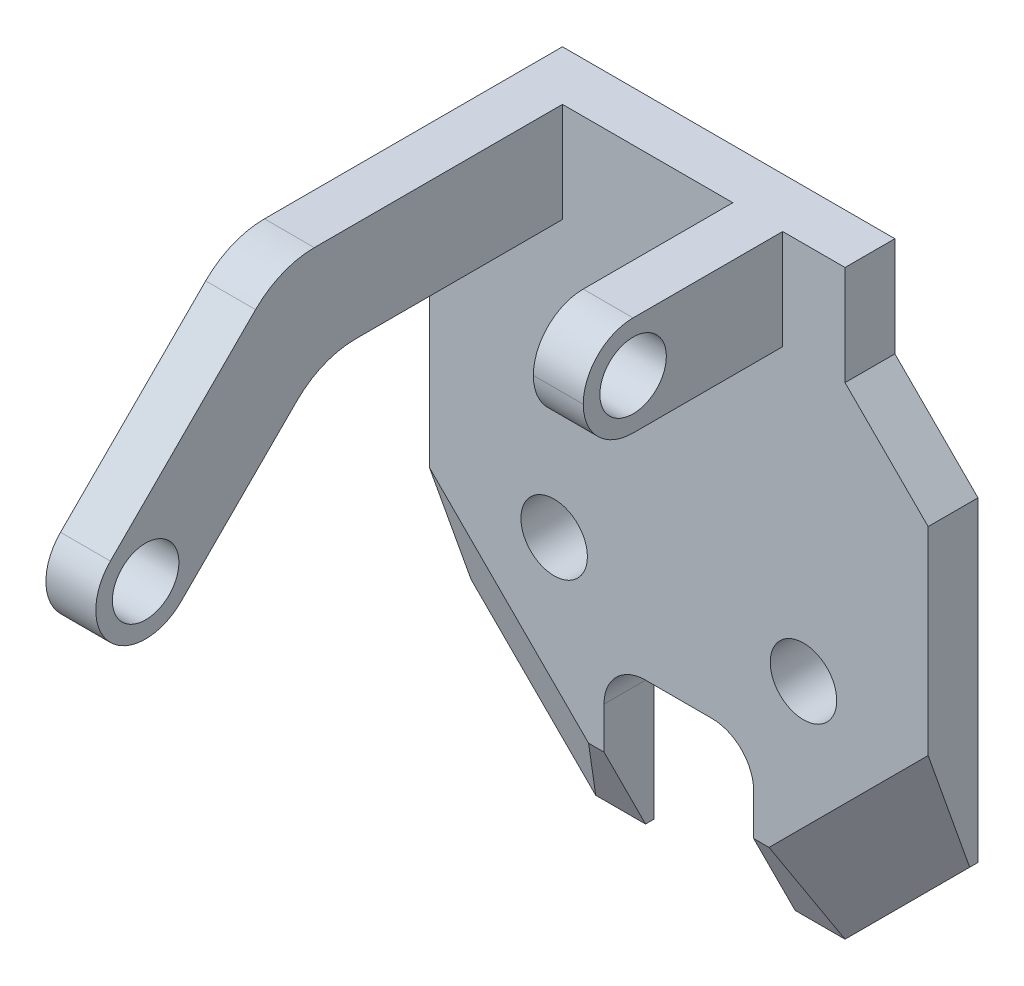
ISO-10303-21;
HEADER;
FILE_DESCRIPTION(('STEP AP214'),'2;1');
FILE_NAME('part.step','',(''),(''),'','','');
FILE_SCHEMA(('AUTOMOTIVE_DESIGN { 1 0 10303 214 1 1 1 1 }'));
ENDSEC;
DATA;
#1=APPLICATION_CONTEXT('core data for automotive mechanical design processes');
#2=APPLICATION_PROTOCOL_DEFINITION('international standard','automotive_design',2000,#1);
#3=PRODUCT_CONTEXT('',#1,'mechanical');
#4=PRODUCT('Part','Part','',(#3));
#5=PRODUCT_RELATED_PRODUCT_CATEGORY('part','',(#4));
#6=PRODUCT_DEFINITION_FORMATION('','',#4);
#7=PRODUCT_DEFINITION_CONTEXT('part definition',#1,'design');
#8=PRODUCT_DEFINITION('design','',#6,#7);
#9=PRODUCT_DEFINITION_SHAPE('','',#8);
#10=(LENGTH_UNIT() NAMED_UNIT(*) SI_UNIT(.MILLI.,.METRE.));
#11=(NAMED_UNIT(*) PLANE_ANGLE_UNIT() SI_UNIT($,.RADIAN.));
#12=(NAMED_UNIT(*) SI_UNIT($,.STERADIAN.) SOLID_ANGLE_UNIT());
#13=UNCERTAINTY_MEASURE_WITH_UNIT(LENGTH_MEASURE(1.E-05),#10,'distance_accuracy_value','');
#14=(GEOMETRIC_REPRESENTATION_CONTEXT(3) GLOBAL_UNCERTAINTY_ASSIGNED_CONTEXT((#13)) GLOBAL_UNIT_ASSIGNED_CONTEXT((#10,
#11,#12)) REPRESENTATION_CONTEXT('',''));
#15=CARTESIAN_POINT('',(0.,0.,0.));
#16=DIRECTION('',(0.,0.,1.));
#17=DIRECTION('',(1.,0.,0.));
#18=AXIS2_PLACEMENT_3D('',#15,#16,#17);
#19=CARTESIAN_POINT('',(0.,0.,6.));
#20=DIRECTION('',(0.,0.,1.));
#21=DIRECTION('',(1.,0.,0.));
#22=AXIS2_PLACEMENT_3D('',#19,#20,#21);
#23=PLANE('',#22);
#24=CARTESIAN_POINT('',(-37.6055090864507,-42.5992218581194,6.));
#25=DIRECTION('',(0.,0.,1.));
#26=DIRECTION('',(1.,0.,0.));
#27=AXIS2_PLACEMENT_3D('',#24,#25,#26);
#28=CIRCLE('',#27,4.00000000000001);
#29=CARTESIAN_POINT('',(-33.6055090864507,-42.5992218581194,6.));
#30=VERTEX_POINT('',#29);
#31=EDGE_CURVE('E479',#30,#30,#28,.T.);
#32=ORIENTED_EDGE('',*,*,#31,.F.);
#33=EDGE_LOOP('',(#32));
#34=FACE_BOUND('',#33,.T.);
#35=CARTESIAN_POINT('',(-7.60550908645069,-42.5992218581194,6.));
#36=DIRECTION('',(0.,0.,1.));
#37=DIRECTION('',(1.,0.,0.));
#38=AXIS2_PLACEMENT_3D('',#35,#36,#37);
#39=CIRCLE('',#38,4.);
#40=CARTESIAN_POINT('',(-3.60550908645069,-42.5992218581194,6.));
#41=VERTEX_POINT('',#40);
#42=EDGE_CURVE('E484',#41,#41,#39,.T.);
#43=ORIENTED_EDGE('',*,*,#42,.F.);
#44=EDGE_LOOP('',(#43));
#45=FACE_BOUND('',#44,.T.);
#46=DIRECTION('',(1.,0.,0.));
#47=VECTOR('',#46,1.);
#48=CARTESIAN_POINT('',(-16.1055090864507,-8.97033508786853,6.));
#49=LINE('',#48,#47);
#50=CARTESIAN_POINT('',(-16.1055090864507,-8.97033508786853,6.));
#51=VERTEX_POINT('',#50);
#52=CARTESIAN_POINT('',(-10.1055090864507,-8.97033508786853,6.));
#53=VERTEX_POINT('',#52);
#54=EDGE_CURVE('E253',#51,#53,#49,.T.);
#55=ORIENTED_EDGE('',*,*,#54,.F.);
#56=DIRECTION('',(0.,-1.,0.));
#57=VECTOR('',#56,1.);
#58=CARTESIAN_POINT('',(-16.1055090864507,0.,6.));
#59=LINE('',#58,#57);
#60=CARTESIAN_POINT('',(-16.1055090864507,3.02966491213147,6.));
#61=VERTEX_POINT('',#60);
#62=EDGE_CURVE('E251',#61,#51,#59,.T.);
#63=ORIENTED_EDGE('',*,*,#62,.F.);
#64=DIRECTION('',(-1.,0.,0.));
#65=VECTOR('',#64,1.);
#66=CARTESIAN_POINT('',(-2.6055090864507,3.02966491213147,6.));
#67=LINE('',#66,#65);
#68=CARTESIAN_POINT('',(-36.6055090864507,3.02966491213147,6.));
#69=VERTEX_POINT('',#68);
#70=EDGE_CURVE('E238',#61,#69,#67,.T.);
#71=ORIENTED_EDGE('',*,*,#70,.T.);
#72=DIRECTION('',(0.,-1.,0.));
#73=VECTOR('',#72,1.);
#74=CARTESIAN_POINT('',(-36.6055090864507,0.,6.));
#75=LINE('',#74,#73);
#76=CARTESIAN_POINT('',(-36.6055090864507,-8.97033508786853,6.));
#77=VERTEX_POINT('',#76);
#78=EDGE_CURVE('E311',#69,#77,#75,.T.);
#79=ORIENTED_EDGE('',*,*,#78,.T.);
#80=DIRECTION('',(-1.,0.,0.));
#81=VECTOR('',#80,1.);
#82=CARTESIAN_POINT('',(0.,-8.97033508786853,6.));
#83=LINE('',#82,#81);
#84=CARTESIAN_POINT('',(-42.6055090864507,-8.97033508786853,6.));
#85=VERTEX_POINT('',#84);
#86=EDGE_CURVE('E327',#77,#85,#83,.T.);
#87=ORIENTED_EDGE('',*,*,#86,.T.);
#88=DIRECTION('',(-0.707106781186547,-0.707106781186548,0.));
#89=VECTOR('',#88,1.);
#90=CARTESIAN_POINT('',(-42.6055090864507,-8.97033508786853,6.));
#91=LINE('',#90,#89);
#92=CARTESIAN_POINT('',(-52.6055090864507,-18.9703350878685,6.));
#93=VERTEX_POINT('',#92);
#94=EDGE_CURVE('E351',#85,#93,#91,.T.);
#95=ORIENTED_EDGE('',*,*,#94,.T.);
#96=DIRECTION('',(0.,-1.,0.));
#97=VECTOR('',#96,1.);
#98=CARTESIAN_POINT('',(-52.6055090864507,-18.9703350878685,6.));
#99=LINE('',#98,#97);
#100=CARTESIAN_POINT('',(-52.6055090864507,-42.8281994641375,6.));
#101=VERTEX_POINT('',#100);
#102=EDGE_CURVE('E353',#93,#101,#99,.T.);
#103=ORIENTED_EDGE('',*,*,#102,.T.);
#104=DIRECTION('',(0.707106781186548,-0.707106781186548,0.));
#105=VECTOR('',#104,1.);
#106=CARTESIAN_POINT('',(-30.5344412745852,-64.899267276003,6.));
#107=LINE('',#106,#105);
#108=CARTESIAN_POINT('',(-33.4633734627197,-61.9703350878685,6.));
#109=VERTEX_POINT('',#108);
#110=EDGE_CURVE('E435',#101,#109,#107,.T.);
#111=ORIENTED_EDGE('',*,*,#110,.T.);
#112=DIRECTION('',(1.,0.,0.));
#113=VECTOR('',#112,1.);
#114=CARTESIAN_POINT('',(-31.6055090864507,-61.9703350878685,6.));
#115=LINE('',#114,#113);
#116=CARTESIAN_POINT('',(-31.6055090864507,-61.9703350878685,6.));
#117=VERTEX_POINT('',#116);
#118=EDGE_CURVE('E433',#109,#117,#115,.T.);
#119=ORIENTED_EDGE('',*,*,#118,.T.);
#120=DIRECTION('',(0.,-1.,0.));
#121=VECTOR('',#120,1.);
#122=CARTESIAN_POINT('',(-31.6055090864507,-91.9703350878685,6.));
#123=LINE('',#122,#121);
#124=CARTESIAN_POINT('',(-31.6055090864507,-56.9703350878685,6.));
#125=VERTEX_POINT('',#124);
#126=EDGE_CURVE('E335',#125,#117,#123,.T.);
#127=ORIENTED_EDGE('',*,*,#126,.F.);
#128=CARTESIAN_POINT('',(-26.6055090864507,-56.9703350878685,6.));
#129=DIRECTION('',(0.,0.,1.));
#130=DIRECTION('',(1.,0.,0.));
#131=AXIS2_PLACEMENT_3D('',#128,#129,#130);
#132=CIRCLE('',#131,5.);
#133=CARTESIAN_POINT('',(-26.6055090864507,-51.9703350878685,6.));
#134=VERTEX_POINT('',#133);
#135=EDGE_CURVE('E429',#125,#134,#132,.F.);
#136=ORIENTED_EDGE('',*,*,#135,.T.);
#137=DIRECTION('',(-1.,0.,0.));
#138=VECTOR('',#137,1.);
#139=CARTESIAN_POINT('',(-31.6055090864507,-51.9703350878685,6.));
#140=LINE('',#139,#138);
#141=CARTESIAN_POINT('',(-18.6055090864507,-51.9703350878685,6.));
#142=VERTEX_POINT('',#141);
#143=EDGE_CURVE('E340',#142,#134,#140,.T.);
#144=ORIENTED_EDGE('',*,*,#143,.F.);
#145=CARTESIAN_POINT('',(-18.6055090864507,-56.9703350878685,6.));
#146=DIRECTION('',(0.,0.,1.));
#147=DIRECTION('',(1.,0.,0.));
#148=AXIS2_PLACEMENT_3D('',#145,#146,#147);
#149=CIRCLE('',#148,5.);
#150=CARTESIAN_POINT('',(-13.6055090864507,-56.9703350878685,6.));
#151=VERTEX_POINT('',#150);
#152=EDGE_CURVE('E424',#142,#151,#149,.F.);
#153=ORIENTED_EDGE('',*,*,#152,.T.);
#154=DIRECTION('',(0.,1.,0.));
#155=VECTOR('',#154,1.);
#156=CARTESIAN_POINT('',(-13.6055090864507,-91.9703350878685,6.));
#157=LINE('',#156,#155);
#158=CARTESIAN_POINT('',(-13.6055090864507,-61.9703350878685,6.));
#159=VERTEX_POINT('',#158);
#160=EDGE_CURVE('E338',#159,#151,#157,.T.);
#161=ORIENTED_EDGE('',*,*,#160,.F.);
#162=DIRECTION('',(1.,0.,0.));
#163=VECTOR('',#162,1.);
#164=CARTESIAN_POINT('',(-7.60550908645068,-61.9703350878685,6.));
#165=LINE('',#164,#163);
#166=CARTESIAN_POINT('',(-11.7476447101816,-61.9703350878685,6.));
#167=VERTEX_POINT('',#166);
#168=EDGE_CURVE('E438',#159,#167,#165,.T.);
#169=ORIENTED_EDGE('',*,*,#168,.T.);
#170=DIRECTION('',(0.707106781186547,0.707106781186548,0.));
#171=VECTOR('',#170,1.);
#172=CARTESIAN_POINT('',(0.323423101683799,-49.899267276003,6.));
#173=LINE('',#172,#171);
#174=CARTESIAN_POINT('',(7.39449091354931,-42.8281994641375,6.));
#175=VERTEX_POINT('',#174);
#176=EDGE_CURVE('E440',#167,#175,#173,.T.);
#177=ORIENTED_EDGE('',*,*,#176,.T.);
#178=DIRECTION('',(0.,1.,0.));
#179=VECTOR('',#178,1.);
#180=CARTESIAN_POINT('',(7.39449091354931,-56.9703350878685,6.));
#181=LINE('',#180,#179);
#182=CARTESIAN_POINT('',(7.3944909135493,-18.9703350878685,6.));
#183=VERTEX_POINT('',#182);
#184=EDGE_CURVE('E357',#175,#183,#181,.T.);
#185=ORIENTED_EDGE('',*,*,#184,.T.);
#186=DIRECTION('',(-0.707106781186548,0.707106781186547,0.));
#187=VECTOR('',#186,1.);
#188=CARTESIAN_POINT('',(7.3944909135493,-18.9703350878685,6.));
#189=LINE('',#188,#187);
#190=CARTESIAN_POINT('',(-2.6055090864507,-8.97033508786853,6.));
#191=VERTEX_POINT('',#190);
#192=EDGE_CURVE('E248',#183,#191,#189,.T.);
#193=ORIENTED_EDGE('',*,*,#192,.T.);
#194=DIRECTION('',(0.,-1.,0.));
#195=VECTOR('',#194,1.);
#196=CARTESIAN_POINT('',(-2.6055090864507,-8.97033508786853,6.));
#197=LINE('',#196,#195);
#198=CARTESIAN_POINT('',(-2.6055090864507,3.02966491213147,6.));
#199=VERTEX_POINT('',#198);
#200=EDGE_CURVE('E278',#199,#191,#197,.T.);
#201=ORIENTED_EDGE('',*,*,#200,.F.);
#202=CARTESIAN_POINT('',(-10.1055090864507,3.02966491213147,6.));
#203=VERTEX_POINT('',#202);
#204=EDGE_CURVE('E247',#199,#203,#67,.T.);
#205=ORIENTED_EDGE('',*,*,#204,.T.);
#206=DIRECTION('',(0.,-1.,0.));
#207=VECTOR('',#206,1.);
#208=CARTESIAN_POINT('',(-10.1055090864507,0.,6.));
#209=LINE('',#208,#207);
#210=EDGE_CURVE('E258',#203,#53,#209,.T.);
#211=ORIENTED_EDGE('',*,*,#210,.T.);
#212=EDGE_LOOP('',(#55,#63,#71,#79,#87,#95,#103,#111,#119,#127,#136,#144,#153,#161,#169,#177,
#185,#193,#201,#205,#211));
#213=FACE_BOUND('',#212,.T.);
#214=ADVANCED_FACE('F40',(#34,#45,#213),#23,.T.);
#215=CARTESIAN_POINT('',(-37.6055090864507,-71.9703350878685,6.));
#216=DIRECTION('',(0.,1.,0.));
#217=DIRECTION('',(0.,0.,1.));
#218=AXIS2_PLACEMENT_3D('',#215,#216,#217);
#219=PLANE('',#218);
#220=DIRECTION('',(0.,0.,-1.));
#221=VECTOR('',#220,1.);
#222=CARTESIAN_POINT('',(-7.60550908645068,-71.9703350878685,6.));
#223=LINE('',#222,#221);
#224=CARTESIAN_POINT('',(-7.60550908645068,-71.9703350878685,1.));
#225=VERTEX_POINT('',#224);
#226=CARTESIAN_POINT('',(-7.60550908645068,-71.9703350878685,0.));
#227=VERTEX_POINT('',#226);
#228=EDGE_CURVE('E399',#225,#227,#223,.T.);
#229=ORIENTED_EDGE('',*,*,#228,.F.);
#230=DIRECTION('',(-1.,0.,0.));
#231=VECTOR('',#230,1.);
#232=CARTESIAN_POINT('',(-13.6055090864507,-71.9703350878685,1.));
#233=LINE('',#232,#231);
#234=CARTESIAN_POINT('',(-13.6055090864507,-71.9703350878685,1.));
#235=VERTEX_POINT('',#234);
#236=EDGE_CURVE('E447',#225,#235,#233,.T.);
#237=ORIENTED_EDGE('',*,*,#236,.T.);
#238=DIRECTION('',(0.,0.,-1.));
#239=VECTOR('',#238,1.);
#240=CARTESIAN_POINT('',(-13.6055090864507,-71.9703350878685,6.));
#241=LINE('',#240,#239);
#242=CARTESIAN_POINT('',(-13.6055090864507,-71.9703350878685,0.));
#243=VERTEX_POINT('',#242);
#244=EDGE_CURVE('E348',#235,#243,#241,.T.);
#245=ORIENTED_EDGE('',*,*,#244,.T.);
#246=DIRECTION('',(1.,0.,0.));
#247=VECTOR('',#246,1.);
#248=CARTESIAN_POINT('',(-37.6055090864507,-71.9703350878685,0.));
#249=LINE('',#248,#247);
#250=EDGE_CURVE('E372',#243,#227,#249,.T.);
#251=ORIENTED_EDGE('',*,*,#250,.T.);
#252=EDGE_LOOP('',(#229,#237,#245,#251));
#253=FACE_BOUND('',#252,.T.);
#254=ADVANCED_FACE('F495',(#253),#219,.F.);
#255=CARTESIAN_POINT('',(-42.6055090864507,3.02966491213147,6.));
#256=DIRECTION('',(1.,0.,0.));
#257=DIRECTION('',(0.,0.,-1.));
#258=AXIS2_PLACEMENT_3D('',#255,#256,#257);
#259=PLANE('',#258);
#260=CARTESIAN_POINT('',(-42.6055090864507,-21.609450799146,56.1538343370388));
#261=DIRECTION('',(-1.,0.,0.));
#262=DIRECTION('',(0.,0.,1.));
#263=AXIS2_PLACEMENT_3D('',#260,#261,#262);
#264=CIRCLE('',#263,4.00000000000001);
#265=CARTESIAN_POINT('',(-42.6055090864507,-21.609450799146,60.1538343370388));
#266=VERTEX_POINT('',#265);
#267=EDGE_CURVE('E274',#266,#266,#264,.T.);
#268=ORIENTED_EDGE('',*,*,#267,.F.);
#269=EDGE_LOOP('',(#268));
#270=FACE_BOUND('',#269,.T.);
#271=DIRECTION('',(0.,-1.,0.));
#272=VECTOR('',#271,1.);
#273=CARTESIAN_POINT('',(-42.6055090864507,3.02966491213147,0.));
#274=LINE('',#273,#272);
#275=CARTESIAN_POINT('',(-42.6055090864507,3.02966491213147,0.));
#276=VERTEX_POINT('',#275);
#277=CARTESIAN_POINT('',(-42.6055090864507,-8.97033508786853,0.));
#278=VERTEX_POINT('',#277);
#279=EDGE_CURVE('E350',#276,#278,#274,.T.);
#280=ORIENTED_EDGE('',*,*,#279,.T.);
#281=DIRECTION('',(0.,0.,-1.));
#282=VECTOR('',#281,1.);
#283=CARTESIAN_POINT('',(-42.6055090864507,-8.97033508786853,6.));
#284=LINE('',#283,#282);
#285=EDGE_CURVE('E408',#85,#278,#284,.T.);
#286=ORIENTED_EDGE('',*,*,#285,.F.);
#287=DIRECTION('',(0.,0.,-1.));
#288=VECTOR('',#287,1.);
#289=CARTESIAN_POINT('',(-42.6055090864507,-8.97033508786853,0.));
#290=LINE('',#289,#288);
#291=CARTESIAN_POINT('',(-42.6055090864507,-8.97033508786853,30.8873016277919));
#292=VERTEX_POINT('',#291);
#293=EDGE_CURVE('E280',#292,#85,#290,.T.);
#294=ORIENTED_EDGE('',*,*,#293,.F.);
#295=CARTESIAN_POINT('',(-42.6055090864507,-18.9703350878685,30.8873016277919));
#296=DIRECTION('',(-1.,0.,0.));
#297=DIRECTION('',(0.,0.,-1.));
#298=AXIS2_PLACEMENT_3D('',#295,#296,#297);
#299=CIRCLE('',#298,10.);
#300=CARTESIAN_POINT('',(-42.6055090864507,-11.8992672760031,37.9583694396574));
#301=VERTEX_POINT('',#300);
#302=EDGE_CURVE('E299',#301,#292,#299,.T.);
#303=ORIENTED_EDGE('',*,*,#302,.F.);
#304=DIRECTION('',(0.,0.707106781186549,-0.707106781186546));
#305=VECTOR('',#304,1.);
#306=CARTESIAN_POINT('',(-42.6055090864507,-11.8992672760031,37.9583694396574));
#307=LINE('',#306,#305);
#308=CARTESIAN_POINT('',(-42.6055090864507,-25.8520914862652,51.9111936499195));
#309=VERTEX_POINT('',#308);
#310=EDGE_CURVE('E301',#309,#301,#307,.T.);
#311=ORIENTED_EDGE('',*,*,#310,.F.);
#312=CARTESIAN_POINT('',(-42.6055090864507,-21.609450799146,56.1538343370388));
#313=DIRECTION('',(1.,0.,0.));
#314=DIRECTION('',(0.,0.,-1.));
#315=AXIS2_PLACEMENT_3D('',#312,#313,#314);
#316=CIRCLE('',#315,6.);
#317=CARTESIAN_POINT('',(-42.6055090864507,-17.3668101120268,60.3964750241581));
#318=VERTEX_POINT('',#317);
#319=EDGE_CURVE('E303',#318,#309,#316,.T.);
#320=ORIENTED_EDGE('',*,*,#319,.F.);
#321=DIRECTION('',(0.,-0.707106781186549,0.707106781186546));
#322=VECTOR('',#321,1.);
#323=CARTESIAN_POINT('',(-42.6055090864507,0.100732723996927,42.9289321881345));
#324=LINE('',#323,#322);
#325=CARTESIAN_POINT('',(-42.6055090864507,0.10073272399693,42.9289321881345));
#326=VERTEX_POINT('',#325);
#327=EDGE_CURVE('E305',#326,#318,#324,.T.);
#328=ORIENTED_EDGE('',*,*,#327,.F.);
#329=CARTESIAN_POINT('',(-42.6055090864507,-6.97033508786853,35.857864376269));
#330=DIRECTION('',(1.,0.,0.));
#331=DIRECTION('',(0.,0.,-1.));
#332=AXIS2_PLACEMENT_3D('',#329,#330,#331);
#333=CIRCLE('',#332,9.99999999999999);
#334=CARTESIAN_POINT('',(-42.6055090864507,3.02966491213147,35.857864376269));
#335=VERTEX_POINT('',#334);
#336=EDGE_CURVE('E285',#335,#326,#333,.T.);
#337=ORIENTED_EDGE('',*,*,#336,.F.);
#338=DIRECTION('',(0.,0.,-1.));
#339=VECTOR('',#338,1.);
#340=CARTESIAN_POINT('',(-42.6055090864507,3.02966491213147,6.));
#341=LINE('',#340,#339);
#342=EDGE_CURVE('E361',#335,#276,#341,.T.);
#343=ORIENTED_EDGE('',*,*,#342,.T.);
#344=EDGE_LOOP('',(#280,#286,#294,#303,#311,#320,#328,#337,#343));
#345=FACE_BOUND('',#344,.T.);
#346=ADVANCED_FACE('F501',(#270,#345),#259,.F.);
#347=CARTESIAN_POINT('',(-42.6055090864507,-8.97033508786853,6.));
#348=DIRECTION('',(0.707106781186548,-0.707106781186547,0.));
#349=DIRECTION('',(0.707106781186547,0.707106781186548,0.));
#350=AXIS2_PLACEMENT_3D('',#347,#348,#349);
#351=PLANE('',#350);
#352=DIRECTION('',(-0.707106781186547,-0.707106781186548,0.));
#353=VECTOR('',#352,1.);
#354=CARTESIAN_POINT('',(-42.6055090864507,-8.97033508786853,0.));
#355=LINE('',#354,#353);
#356=CARTESIAN_POINT('',(-52.6055090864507,-18.9703350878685,0.));
#357=VERTEX_POINT('',#356);
#358=EDGE_CURVE('E364',#278,#357,#355,.T.);
#359=ORIENTED_EDGE('',*,*,#358,.T.);
#360=DIRECTION('',(0.,0.,-1.));
#361=VECTOR('',#360,1.);
#362=CARTESIAN_POINT('',(-52.6055090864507,-18.9703350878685,6.));
#363=LINE('',#362,#361);
#364=EDGE_CURVE('E405',#93,#357,#363,.T.);
#365=ORIENTED_EDGE('',*,*,#364,.F.);
#366=ORIENTED_EDGE('',*,*,#94,.F.);
#367=ORIENTED_EDGE('',*,*,#285,.T.);
#368=EDGE_LOOP('',(#359,#365,#366,#367));
#369=FACE_BOUND('',#368,.T.);
#370=ADVANCED_FACE('F540',(#369),#351,.F.);
#371=CARTESIAN_POINT('',(-52.6055090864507,-18.9703350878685,6.));
#372=DIRECTION('',(1.,0.,0.));
#373=DIRECTION('',(0.,1.,0.));
#374=AXIS2_PLACEMENT_3D('',#371,#372,#373);
#375=PLANE('',#374);
#376=DIRECTION('',(0.,0.,-1.));
#377=VECTOR('',#376,1.);
#378=CARTESIAN_POINT('',(-52.6055090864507,-56.9703350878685,6.));
#379=LINE('',#378,#377);
#380=CARTESIAN_POINT('',(-52.6055090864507,-56.9703350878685,1.));
#381=VERTEX_POINT('',#380);
#382=CARTESIAN_POINT('',(-52.6055090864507,-56.9703350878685,0.));
#383=VERTEX_POINT('',#382);
#384=EDGE_CURVE('E403',#381,#383,#379,.T.);
#385=ORIENTED_EDGE('',*,*,#384,.F.);
#386=DIRECTION('',(0.,0.942809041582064,0.333333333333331));
#387=VECTOR('',#386,1.);
#388=CARTESIAN_POINT('',(-52.6055090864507,-47.1736704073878,4.46364401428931));
#389=LINE('',#388,#387);
#390=EDGE_CURVE('E453',#381,#101,#389,.T.);
#391=ORIENTED_EDGE('',*,*,#390,.T.);
#392=ORIENTED_EDGE('',*,*,#102,.F.);
#393=ORIENTED_EDGE('',*,*,#364,.T.);
#394=DIRECTION('',(0.,-1.,0.));
#395=VECTOR('',#394,1.);
#396=CARTESIAN_POINT('',(-52.6055090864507,-18.9703350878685,0.));
#397=LINE('',#396,#395);
#398=EDGE_CURVE('E366',#357,#383,#397,.T.);
#399=ORIENTED_EDGE('',*,*,#398,.T.);
#400=EDGE_LOOP('',(#385,#391,#392,#393,#399));
#401=FACE_BOUND('',#400,.T.);
#402=ADVANCED_FACE('F536',(#401),#375,.F.);
#403=CARTESIAN_POINT('',(-52.6055090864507,-56.9703350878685,6.));
#404=DIRECTION('',(0.707106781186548,0.707106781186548,0.));
#405=DIRECTION('',(-0.707106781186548,0.707106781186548,0.));
#406=AXIS2_PLACEMENT_3D('',#403,#404,#405);
#407=PLANE('',#406);
#408=DIRECTION('',(0.,0.,-1.));
#409=VECTOR('',#408,1.);
#410=CARTESIAN_POINT('',(-37.6055090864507,-71.9703350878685,6.));
#411=LINE('',#410,#409);
#412=CARTESIAN_POINT('',(-37.6055090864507,-71.9703350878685,1.));
#413=VERTEX_POINT('',#412);
#414=CARTESIAN_POINT('',(-37.6055090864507,-71.9703350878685,0.));
#415=VERTEX_POINT('',#414);
#416=EDGE_CURVE('E401',#413,#415,#411,.T.);
#417=ORIENTED_EDGE('',*,*,#416,.F.);
#418=DIRECTION('',(-0.707106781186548,0.707106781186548,0.));
#419=VECTOR('',#418,1.);
#420=CARTESIAN_POINT('',(-52.6055090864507,-56.9703350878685,1.));
#421=LINE('',#420,#419);
#422=EDGE_CURVE('E451',#413,#381,#421,.T.);
#423=ORIENTED_EDGE('',*,*,#422,.T.);
#424=ORIENTED_EDGE('',*,*,#384,.T.);
#425=DIRECTION('',(0.707106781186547,-0.707106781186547,0.));
#426=VECTOR('',#425,1.);
#427=CARTESIAN_POINT('',(-52.6055090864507,-56.9703350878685,0.));
#428=LINE('',#427,#426);
#429=EDGE_CURVE('E369',#383,#415,#428,.T.);
#430=ORIENTED_EDGE('',*,*,#429,.T.);
#431=EDGE_LOOP('',(#417,#423,#424,#430));
#432=FACE_BOUND('',#431,.T.);
#433=ADVANCED_FACE('F532',(#432),#407,.F.);
#434=DIRECTION('',(0.,0.,1.));
#435=VECTOR('',#434,1.);
#436=CARTESIAN_POINT('',(-31.6055090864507,-71.9703350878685,6.));
#437=LINE('',#436,#435);
#438=CARTESIAN_POINT('',(-31.6055090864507,-71.9703350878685,0.));
#439=VERTEX_POINT('',#438);
#440=CARTESIAN_POINT('',(-31.6055090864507,-71.9703350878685,1.));
#441=VERTEX_POINT('',#440);
#442=EDGE_CURVE('E337',#439,#441,#437,.T.);
#443=ORIENTED_EDGE('',*,*,#442,.T.);
#444=DIRECTION('',(-1.,0.,0.));
#445=VECTOR('',#444,1.);
#446=CARTESIAN_POINT('',(-37.6055090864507,-71.9703350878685,1.));
#447=LINE('',#446,#445);
#448=EDGE_CURVE('E457',#441,#413,#447,.T.);
#449=ORIENTED_EDGE('',*,*,#448,.T.);
#450=ORIENTED_EDGE('',*,*,#416,.T.);
#451=EDGE_CURVE('E373',#415,#439,#249,.T.);
#452=ORIENTED_EDGE('',*,*,#451,.T.);
#453=EDGE_LOOP('',(#443,#449,#450,#452));
#454=FACE_BOUND('',#453,.T.);
#455=ADVANCED_FACE('F504',(#454),#219,.F.);
#456=CARTESIAN_POINT('',(-7.60550908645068,-71.9703350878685,6.));
#457=DIRECTION('',(-0.707106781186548,0.707106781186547,0.));
#458=DIRECTION('',(-0.707106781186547,-0.707106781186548,0.));
#459=AXIS2_PLACEMENT_3D('',#456,#457,#458);
#460=PLANE('',#459);
#461=DIRECTION('',(0.,0.,-1.));
#462=VECTOR('',#461,1.);
#463=CARTESIAN_POINT('',(7.39449091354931,-56.9703350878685,6.));
#464=LINE('',#463,#462);
#465=CARTESIAN_POINT('',(7.39449091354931,-56.9703350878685,1.));
#466=VERTEX_POINT('',#465);
#467=CARTESIAN_POINT('',(7.39449091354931,-56.9703350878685,0.));
#468=VERTEX_POINT('',#467);
#469=EDGE_CURVE('E397',#466,#468,#464,.T.);
#470=ORIENTED_EDGE('',*,*,#469,.F.);
#471=DIRECTION('',(-0.707106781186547,-0.707106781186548,0.));
#472=VECTOR('',#471,1.);
#473=CARTESIAN_POINT('',(-7.60550908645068,-71.9703350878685,1.));
#474=LINE('',#473,#472);
#475=EDGE_CURVE('E445',#466,#225,#474,.T.);
#476=ORIENTED_EDGE('',*,*,#475,.T.);
#477=ORIENTED_EDGE('',*,*,#228,.T.);
#478=DIRECTION('',(0.707106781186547,0.707106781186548,0.));
#479=VECTOR('',#478,1.);
#480=CARTESIAN_POINT('',(-7.60550908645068,-71.9703350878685,0.));
#481=LINE('',#480,#479);
#482=EDGE_CURVE('E376',#227,#468,#481,.T.);
#483=ORIENTED_EDGE('',*,*,#482,.T.);
#484=EDGE_LOOP('',(#470,#476,#477,#483));
#485=FACE_BOUND('',#484,.T.);
#486=ADVANCED_FACE('F526',(#485),#460,.F.);
#487=CARTESIAN_POINT('',(7.39449091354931,-56.9703350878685,6.));
#488=DIRECTION('',(-1.,0.,0.));
#489=DIRECTION('',(0.,-1.,0.));
#490=AXIS2_PLACEMENT_3D('',#487,#488,#489);
#491=PLANE('',#490);
#492=ORIENTED_EDGE('',*,*,#184,.F.);
#493=DIRECTION('',(0.,-0.942809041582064,-0.333333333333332));
#494=VECTOR('',#493,1.);
#495=CARTESIAN_POINT('',(7.3944909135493,-27.0798845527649,11.5678701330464));
#496=LINE('',#495,#494);
#497=EDGE_CURVE('E443',#175,#466,#496,.T.);
#498=ORIENTED_EDGE('',*,*,#497,.T.);
#499=ORIENTED_EDGE('',*,*,#469,.T.);
#500=DIRECTION('',(0.,1.,0.));
#501=VECTOR('',#500,1.);
#502=CARTESIAN_POINT('',(7.39449091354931,-56.9703350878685,0.));
#503=LINE('',#502,#501);
#504=CARTESIAN_POINT('',(7.3944909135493,-18.9703350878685,0.));
#505=VERTEX_POINT('',#504);
#506=EDGE_CURVE('E379',#468,#505,#503,.T.);
#507=ORIENTED_EDGE('',*,*,#506,.T.);
#508=DIRECTION('',(0.,0.,-1.));
#509=VECTOR('',#508,1.);
#510=CARTESIAN_POINT('',(7.3944909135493,-18.9703350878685,6.));
#511=LINE('',#510,#509);
#512=EDGE_CURVE('E394',#183,#505,#511,.T.);
#513=ORIENTED_EDGE('',*,*,#512,.F.);
#514=EDGE_LOOP('',(#492,#498,#499,#507,#513));
#515=FACE_BOUND('',#514,.T.);
#516=ADVANCED_FACE('F522',(#515),#491,.F.);
#517=CARTESIAN_POINT('',(7.3944909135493,-18.9703350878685,6.));
#518=DIRECTION('',(-0.707106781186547,-0.707106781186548,0.));
#519=DIRECTION('',(0.707106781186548,-0.707106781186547,0.));
#520=AXIS2_PLACEMENT_3D('',#517,#518,#519);
#521=PLANE('',#520);
#522=DIRECTION('',(-0.707106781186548,0.707106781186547,0.));
#523=VECTOR('',#522,1.);
#524=CARTESIAN_POINT('',(7.3944909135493,-18.9703350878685,0.));
#525=LINE('',#524,#523);
#526=CARTESIAN_POINT('',(-2.6055090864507,-8.97033508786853,0.));
#527=VERTEX_POINT('',#526);
#528=EDGE_CURVE('E381',#505,#527,#525,.T.);
#529=ORIENTED_EDGE('',*,*,#528,.T.);
#530=DIRECTION('',(0.,0.,-1.));
#531=VECTOR('',#530,1.);
#532=CARTESIAN_POINT('',(-2.6055090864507,-8.97033508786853,6.));
#533=LINE('',#532,#531);
#534=EDGE_CURVE('E391',#191,#527,#533,.T.);
#535=ORIENTED_EDGE('',*,*,#534,.F.);
#536=ORIENTED_EDGE('',*,*,#192,.F.);
#537=ORIENTED_EDGE('',*,*,#512,.T.);
#538=EDGE_LOOP('',(#529,#535,#536,#537));
#539=FACE_BOUND('',#538,.T.);
#540=ADVANCED_FACE('F518',(#539),#521,.F.);
#541=CARTESIAN_POINT('',(-2.6055090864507,-8.97033508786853,6.));
#542=DIRECTION('',(-1.,0.,0.));
#543=DIRECTION('',(0.,0.,1.));
#544=AXIS2_PLACEMENT_3D('',#541,#542,#543);
#545=PLANE('',#544);
#546=DIRECTION('',(0.,0.,-1.));
#547=VECTOR('',#546,1.);
#548=CARTESIAN_POINT('',(-2.6055090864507,3.02966491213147,6.));
#549=LINE('',#548,#547);
#550=CARTESIAN_POINT('',(-2.6055090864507,3.02966491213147,0.));
#551=VERTEX_POINT('',#550);
#552=EDGE_CURVE('E389',#199,#551,#549,.T.);
#553=ORIENTED_EDGE('',*,*,#552,.F.);
#554=ORIENTED_EDGE('',*,*,#200,.T.);
#555=ORIENTED_EDGE('',*,*,#534,.T.);
#556=DIRECTION('',(0.,1.,0.));
#557=VECTOR('',#556,1.);
#558=CARTESIAN_POINT('',(-2.6055090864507,-8.97033508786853,0.));
#559=LINE('',#558,#557);
#560=EDGE_CURVE('E383',#527,#551,#559,.T.);
#561=ORIENTED_EDGE('',*,*,#560,.T.);
#562=EDGE_LOOP('',(#553,#554,#555,#561));
#563=FACE_BOUND('',#562,.T.);
#564=ADVANCED_FACE('F515',(#563),#545,.F.);
#565=CARTESIAN_POINT('',(-2.6055090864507,3.02966491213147,6.));
#566=DIRECTION('',(0.,-1.,0.));
#567=DIRECTION('',(1.,0.,0.));
#568=AXIS2_PLACEMENT_3D('',#565,#566,#567);
#569=PLANE('',#568);
#570=DIRECTION('',(0.,0.,1.));
#571=VECTOR('',#570,1.);
#572=CARTESIAN_POINT('',(-16.1055090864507,3.02966491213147,0.));
#573=LINE('',#572,#571);
#574=CARTESIAN_POINT('',(-16.1055090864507,3.02966491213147,24.));
#575=VERTEX_POINT('',#574);
#576=EDGE_CURVE('E241',#61,#575,#573,.T.);
#577=ORIENTED_EDGE('',*,*,#576,.T.);
#578=DIRECTION('',(1.,0.,0.));
#579=VECTOR('',#578,1.);
#580=CARTESIAN_POINT('',(-10.1055090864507,3.02966491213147,24.));
#581=LINE('',#580,#579);
#582=CARTESIAN_POINT('',(-10.1055090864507,3.02966491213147,24.));
#583=VERTEX_POINT('',#582);
#584=EDGE_CURVE('E11',#575,#583,#581,.T.);
#585=ORIENTED_EDGE('',*,*,#584,.T.);
#586=DIRECTION('',(0.,0.,1.));
#587=VECTOR('',#586,1.);
#588=CARTESIAN_POINT('',(-10.1055090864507,3.02966491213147,0.));
#589=LINE('',#588,#587);
#590=EDGE_CURVE('E267',#203,#583,#589,.T.);
#591=ORIENTED_EDGE('',*,*,#590,.F.);
#592=ORIENTED_EDGE('',*,*,#204,.F.);
#593=ORIENTED_EDGE('',*,*,#552,.T.);
#594=DIRECTION('',(-1.,0.,0.));
#595=VECTOR('',#594,1.);
#596=CARTESIAN_POINT('',(-2.6055090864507,3.02966491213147,0.));
#597=LINE('',#596,#595);
#598=EDGE_CURVE('E354',#551,#276,#597,.T.);
#599=ORIENTED_EDGE('',*,*,#598,.T.);
#600=ORIENTED_EDGE('',*,*,#342,.F.);
#601=DIRECTION('',(-1.,0.,0.));
#602=VECTOR('',#601,1.);
#603=CARTESIAN_POINT('',(-36.6055090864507,3.02966491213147,35.857864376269));
#604=LINE('',#603,#602);
#605=CARTESIAN_POINT('',(-36.6055090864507,3.02966491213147,35.857864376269));
#606=VERTEX_POINT('',#605);
#607=EDGE_CURVE('E308',#606,#335,#604,.T.);
#608=ORIENTED_EDGE('',*,*,#607,.F.);
#609=DIRECTION('',(0.,0.,1.));
#610=VECTOR('',#609,1.);
#611=CARTESIAN_POINT('',(-36.6055090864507,3.02966491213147,0.));
#612=LINE('',#611,#610);
#613=EDGE_CURVE('E244',#69,#606,#612,.T.);
#614=ORIENTED_EDGE('',*,*,#613,.F.);
#615=ORIENTED_EDGE('',*,*,#70,.F.);
#616=EDGE_LOOP('',(#577,#585,#591,#592,#593,#599,#600,#608,#614,#615));
#617=FACE_BOUND('',#616,.T.);
#618=ADVANCED_FACE('F240',(#617),#569,.F.);
#619=CARTESIAN_POINT('',(0.,0.,0.));
#620=DIRECTION('',(0.,0.,1.));
#621=DIRECTION('',(1.,0.,0.));
#622=AXIS2_PLACEMENT_3D('',#619,#620,#621);
#623=PLANE('',#622);
#624=CARTESIAN_POINT('',(-37.6055090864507,-42.5992218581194,0.));
#625=DIRECTION('',(0.,0.,1.));
#626=DIRECTION('',(1.,0.,0.));
#627=AXIS2_PLACEMENT_3D('',#624,#625,#626);
#628=CIRCLE('',#627,4.00000000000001);
#629=CARTESIAN_POINT('',(-33.6055090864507,-42.5992218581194,0.));
#630=VERTEX_POINT('',#629);
#631=EDGE_CURVE('E44',#630,#630,#628,.T.);
#632=ORIENTED_EDGE('',*,*,#631,.T.);
#633=EDGE_LOOP('',(#632));
#634=FACE_BOUND('',#633,.T.);
#635=CARTESIAN_POINT('',(-7.60550908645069,-42.5992218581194,0.));
#636=DIRECTION('',(0.,0.,1.));
#637=DIRECTION('',(1.,0.,0.));
#638=AXIS2_PLACEMENT_3D('',#635,#636,#637);
#639=CIRCLE('',#638,4.);
#640=CARTESIAN_POINT('',(-3.60550908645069,-42.5992218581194,0.));
#641=VERTEX_POINT('',#640);
#642=EDGE_CURVE('E477',#641,#641,#639,.T.);
#643=ORIENTED_EDGE('',*,*,#642,.T.);
#644=EDGE_LOOP('',(#643));
#645=FACE_BOUND('',#644,.T.);
#646=ORIENTED_EDGE('',*,*,#358,.F.);
#647=ORIENTED_EDGE('',*,*,#279,.F.);
#648=ORIENTED_EDGE('',*,*,#598,.F.);
#649=ORIENTED_EDGE('',*,*,#560,.F.);
#650=ORIENTED_EDGE('',*,*,#528,.F.);
#651=ORIENTED_EDGE('',*,*,#506,.F.);
#652=ORIENTED_EDGE('',*,*,#482,.F.);
#653=ORIENTED_EDGE('',*,*,#250,.F.);
#654=DIRECTION('',(0.,1.,0.));
#655=VECTOR('',#654,1.);
#656=CARTESIAN_POINT('',(-13.6055090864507,0.,0.));
#657=LINE('',#656,#655);
#658=CARTESIAN_POINT('',(-13.6055090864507,-56.9703350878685,0.));
#659=VERTEX_POINT('',#658);
#660=EDGE_CURVE('E411',#243,#659,#657,.T.);
#661=ORIENTED_EDGE('',*,*,#660,.T.);
#662=CARTESIAN_POINT('',(-18.6055090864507,-56.9703350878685,0.));
#663=DIRECTION('',(0.,0.,1.));
#664=DIRECTION('',(1.,0.,0.));
#665=AXIS2_PLACEMENT_3D('',#662,#663,#664);
#666=CIRCLE('',#665,5.);
#667=CARTESIAN_POINT('',(-18.6055090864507,-51.9703350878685,0.));
#668=VERTEX_POINT('',#667);
#669=EDGE_CURVE('E427',#659,#668,#666,.T.);
#670=ORIENTED_EDGE('',*,*,#669,.T.);
#671=DIRECTION('',(-1.,0.,0.));
#672=VECTOR('',#671,1.);
#673=CARTESIAN_POINT('',(-31.6055090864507,-51.9703350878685,0.));
#674=LINE('',#673,#672);
#675=CARTESIAN_POINT('',(-26.6055090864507,-51.9703350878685,0.));
#676=VERTEX_POINT('',#675);
#677=EDGE_CURVE('E331',#668,#676,#674,.T.);
#678=ORIENTED_EDGE('',*,*,#677,.T.);
#679=CARTESIAN_POINT('',(-26.6055090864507,-56.9703350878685,0.));
#680=DIRECTION('',(0.,0.,1.));
#681=DIRECTION('',(1.,0.,0.));
#682=AXIS2_PLACEMENT_3D('',#679,#680,#681);
#683=CIRCLE('',#682,5.);
#684=CARTESIAN_POINT('',(-31.6055090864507,-56.9703350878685,0.));
#685=VERTEX_POINT('',#684);
#686=EDGE_CURVE('E431',#676,#685,#683,.T.);
#687=ORIENTED_EDGE('',*,*,#686,.T.);
#688=DIRECTION('',(0.,-1.,0.));
#689=VECTOR('',#688,1.);
#690=CARTESIAN_POINT('',(-31.6055090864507,-91.9703350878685,0.));
#691=LINE('',#690,#689);
#692=EDGE_CURVE('E334',#685,#439,#691,.T.);
#693=ORIENTED_EDGE('',*,*,#692,.T.);
#694=ORIENTED_EDGE('',*,*,#451,.F.);
#695=ORIENTED_EDGE('',*,*,#429,.F.);
#696=ORIENTED_EDGE('',*,*,#398,.F.);
#697=EDGE_LOOP('',(#646,#647,#648,#649,#650,#651,#652,#653,#661,#670,#678,#687,#693,#694,#695,#696));
#698=FACE_BOUND('',#697,.T.);
#699=ADVANCED_FACE('F509',(#634,#645,#698),#623,.F.);
#700=CARTESIAN_POINT('',(-13.6055090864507,-91.9703350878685,0.));
#701=DIRECTION('',(1.,0.,0.));
#702=DIRECTION('',(0.,0.,-1.));
#703=AXIS2_PLACEMENT_3D('',#700,#701,#702);
#704=PLANE('',#703);
#705=ORIENTED_EDGE('',*,*,#244,.F.);
#706=DIRECTION('',(0.,0.894427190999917,0.447213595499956));
#707=VECTOR('',#706,1.);
#708=CARTESIAN_POINT('',(-13.6055090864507,-61.9703350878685,6.));
#709=LINE('',#708,#707);
#710=EDGE_CURVE('E449',#235,#159,#709,.T.);
#711=ORIENTED_EDGE('',*,*,#710,.T.);
#712=ORIENTED_EDGE('',*,*,#160,.T.);
#713=DIRECTION('',(0.,0.,1.));
#714=VECTOR('',#713,1.);
#715=CARTESIAN_POINT('',(-13.6055090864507,-56.9703350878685,0.));
#716=LINE('',#715,#714);
#717=EDGE_CURVE('E419',#151,#659,#716,.F.);
#718=ORIENTED_EDGE('',*,*,#717,.T.);
#719=ORIENTED_EDGE('',*,*,#660,.F.);
#720=EDGE_LOOP('',(#705,#711,#712,#718,#719));
#721=FACE_BOUND('',#720,.T.);
#722=ADVANCED_FACE('F507',(#721),#704,.F.);
#723=CARTESIAN_POINT('',(-31.6055090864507,-91.9703350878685,0.));
#724=DIRECTION('',(-1.,0.,0.));
#725=DIRECTION('',(0.,0.,1.));
#726=AXIS2_PLACEMENT_3D('',#723,#724,#725);
#727=PLANE('',#726);
#728=ORIENTED_EDGE('',*,*,#126,.T.);
#729=DIRECTION('',(0.,-0.894427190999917,-0.447213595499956));
#730=VECTOR('',#729,1.);
#731=CARTESIAN_POINT('',(-31.6055090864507,-61.9703350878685,6.));
#732=LINE('',#731,#730);
#733=EDGE_CURVE('E455',#117,#441,#732,.T.);
#734=ORIENTED_EDGE('',*,*,#733,.T.);
#735=ORIENTED_EDGE('',*,*,#442,.F.);
#736=ORIENTED_EDGE('',*,*,#692,.F.);
#737=DIRECTION('',(0.,0.,1.));
#738=VECTOR('',#737,1.);
#739=CARTESIAN_POINT('',(-31.6055090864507,-56.9703350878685,6.));
#740=LINE('',#739,#738);
#741=EDGE_CURVE('E421',#685,#125,#740,.T.);
#742=ORIENTED_EDGE('',*,*,#741,.T.);
#743=EDGE_LOOP('',(#728,#734,#735,#736,#742));
#744=FACE_BOUND('',#743,.T.);
#745=ADVANCED_FACE('F651',(#744),#727,.F.);
#746=CARTESIAN_POINT('',(-31.6055090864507,-51.9703350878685,0.));
#747=DIRECTION('',(0.,1.,0.));
#748=DIRECTION('',(0.,0.,1.));
#749=AXIS2_PLACEMENT_3D('',#746,#747,#748);
#750=PLANE('',#749);
#751=ORIENTED_EDGE('',*,*,#677,.F.);
#752=DIRECTION('',(0.,0.,1.));
#753=VECTOR('',#752,1.);
#754=CARTESIAN_POINT('',(-18.6055090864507,-51.9703350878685,6.));
#755=LINE('',#754,#753);
#756=EDGE_CURVE('E416',#668,#142,#755,.T.);
#757=ORIENTED_EDGE('',*,*,#756,.T.);
#758=ORIENTED_EDGE('',*,*,#143,.T.);
#759=DIRECTION('',(0.,0.,1.));
#760=VECTOR('',#759,1.);
#761=CARTESIAN_POINT('',(-26.6055090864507,-51.9703350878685,0.));
#762=LINE('',#761,#760);
#763=EDGE_CURVE('E414',#134,#676,#762,.F.);
#764=ORIENTED_EDGE('',*,*,#763,.T.);
#765=EDGE_LOOP('',(#751,#757,#758,#764));
#766=FACE_BOUND('',#765,.T.);
#767=ADVANCED_FACE('F552',(#766),#750,.F.);
#768=CARTESIAN_POINT('',(-18.6055090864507,-56.9703350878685,0.));
#769=DIRECTION('',(0.,0.,-1.));
#770=DIRECTION('',(-1.,0.,0.));
#771=AXIS2_PLACEMENT_3D('',#768,#769,#770);
#772=CYLINDRICAL_SURFACE('',#771,5.);
#773=ORIENTED_EDGE('',*,*,#669,.F.);
#774=ORIENTED_EDGE('',*,*,#717,.F.);
#775=ORIENTED_EDGE('',*,*,#152,.F.);
#776=ORIENTED_EDGE('',*,*,#756,.F.);
#777=EDGE_LOOP('',(#773,#774,#775,#776));
#778=FACE_BOUND('',#777,.T.);
#779=ADVANCED_FACE('F548',(#778),#772,.F.);
#780=CARTESIAN_POINT('',(-26.6055090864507,-56.9703350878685,0.));
#781=DIRECTION('',(0.,0.,-1.));
#782=DIRECTION('',(-1.,0.,0.));
#783=AXIS2_PLACEMENT_3D('',#780,#781,#782);
#784=CYLINDRICAL_SURFACE('',#783,5.);
#785=ORIENTED_EDGE('',*,*,#686,.F.);
#786=ORIENTED_EDGE('',*,*,#763,.F.);
#787=ORIENTED_EDGE('',*,*,#135,.F.);
#788=ORIENTED_EDGE('',*,*,#741,.F.);
#789=EDGE_LOOP('',(#785,#786,#787,#788));
#790=FACE_BOUND('',#789,.T.);
#791=ADVANCED_FACE('F551',(#790),#784,.F.);
#792=CARTESIAN_POINT('',(0.,-61.9703350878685,6.));
#793=DIRECTION('',(0.,-0.447213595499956,0.894427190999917));
#794=DIRECTION('',(-1.,0.,0.));
#795=AXIS2_PLACEMENT_3D('',#792,#793,#794);
#796=PLANE('',#795);
#797=ORIENTED_EDGE('',*,*,#710,.F.);
#798=ORIENTED_EDGE('',*,*,#236,.F.);
#799=DIRECTION('',(-0.347407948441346,0.838716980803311,0.419358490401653));
#800=VECTOR('',#799,1.);
#801=CARTESIAN_POINT('',(-10.3297946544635,-65.3933279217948,4.28850358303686));
#802=LINE('',#801,#800);
#803=EDGE_CURVE('E341',#167,#225,#802,.F.);
#804=ORIENTED_EDGE('',*,*,#803,.F.);
#805=ORIENTED_EDGE('',*,*,#168,.F.);
#806=EDGE_LOOP('',(#797,#798,#804,#805));
#807=FACE_BOUND('',#806,.T.);
#808=ADVANCED_FACE('F556',(#807),#796,.T.);
#809=CARTESIAN_POINT('',(25.1113451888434,-25.1113451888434,6.));
#810=DIRECTION('',(0.316227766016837,-0.316227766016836,0.894427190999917));
#811=DIRECTION('',(-0.707106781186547,-0.707106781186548,0.));
#812=AXIS2_PLACEMENT_3D('',#809,#810,#811);
#813=PLANE('',#812);
#814=ORIENTED_EDGE('',*,*,#803,.T.);
#815=ORIENTED_EDGE('',*,*,#475,.F.);
#816=ORIENTED_EDGE('',*,*,#497,.F.);
#817=ORIENTED_EDGE('',*,*,#176,.F.);
#818=EDGE_LOOP('',(#814,#815,#816,#817));
#819=FACE_BOUND('',#818,.T.);
#820=ADVANCED_FACE('F559',(#819),#813,.T.);
#821=CARTESIAN_POINT('',(0.,-61.9703350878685,6.));
#822=DIRECTION('',(0.,-0.447213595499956,0.894427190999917));
#823=DIRECTION('',(-1.,0.,0.));
#824=AXIS2_PLACEMENT_3D('',#821,#822,#823);
#825=PLANE('',#824);
#826=ORIENTED_EDGE('',*,*,#733,.F.);
#827=ORIENTED_EDGE('',*,*,#118,.F.);
#828=DIRECTION('',(-0.347407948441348,-0.838716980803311,-0.419358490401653));
#829=VECTOR('',#828,1.);
#830=CARTESIAN_POINT('',(-29.4246025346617,-52.2198795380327,10.8752277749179));
#831=LINE('',#830,#829);
#832=EDGE_CURVE('E330',#413,#109,#831,.F.);
#833=ORIENTED_EDGE('',*,*,#832,.F.);
#834=ORIENTED_EDGE('',*,*,#448,.F.);
#835=EDGE_LOOP('',(#826,#827,#833,#834));
#836=FACE_BOUND('',#835,.T.);
#837=ADVANCED_FACE('F566',(#836),#825,.T.);
#838=CARTESIAN_POINT('',(-47.7168542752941,-47.7168542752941,6.));
#839=DIRECTION('',(-0.316227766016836,-0.316227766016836,0.894427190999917));
#840=DIRECTION('',(-0.707106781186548,0.707106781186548,0.));
#841=AXIS2_PLACEMENT_3D('',#838,#839,#840);
#842=PLANE('',#841);
#843=ORIENTED_EDGE('',*,*,#390,.F.);
#844=ORIENTED_EDGE('',*,*,#422,.F.);
#845=ORIENTED_EDGE('',*,*,#832,.T.);
#846=ORIENTED_EDGE('',*,*,#110,.F.);
#847=EDGE_LOOP('',(#843,#844,#845,#846));
#848=FACE_BOUND('',#847,.T.);
#849=ADVANCED_FACE('F574',(#848),#842,.T.);
#850=CARTESIAN_POINT('',(-36.6055090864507,-6.97033508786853,35.857864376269));
#851=DIRECTION('',(-1.,0.,0.));
#852=DIRECTION('',(0.,0.,1.));
#853=AXIS2_PLACEMENT_3D('',#850,#851,#852);
#854=CYLINDRICAL_SURFACE('',#853,9.99999999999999);
#855=ORIENTED_EDGE('',*,*,#336,.T.);
#856=DIRECTION('',(-1.,0.,0.));
#857=VECTOR('',#856,1.);
#858=CARTESIAN_POINT('',(-36.6055090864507,0.10073272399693,42.9289321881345));
#859=LINE('',#858,#857);
#860=CARTESIAN_POINT('',(-36.6055090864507,0.10073272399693,42.9289321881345));
#861=VERTEX_POINT('',#860);
#862=EDGE_CURVE('E312',#861,#326,#859,.T.);
#863=ORIENTED_EDGE('',*,*,#862,.F.);
#864=CARTESIAN_POINT('',(-36.6055090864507,-6.97033508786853,35.857864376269));
#865=DIRECTION('',(1.,0.,0.));
#866=DIRECTION('',(0.,0.,-1.));
#867=AXIS2_PLACEMENT_3D('',#864,#865,#866);
#868=CIRCLE('',#867,9.99999999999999);
#869=EDGE_CURVE('E293',#606,#861,#868,.T.);
#870=ORIENTED_EDGE('',*,*,#869,.F.);
#871=ORIENTED_EDGE('',*,*,#607,.T.);
#872=EDGE_LOOP('',(#855,#863,#870,#871));
#873=FACE_BOUND('',#872,.T.);
#874=ADVANCED_FACE('F579',(#873),#854,.T.);
#875=CARTESIAN_POINT('',(-36.6055090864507,0.100732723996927,42.9289321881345));
#876=DIRECTION('',(0.,-0.707106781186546,-0.707106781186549));
#877=DIRECTION('',(0.,0.707106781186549,-0.707106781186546));
#878=AXIS2_PLACEMENT_3D('',#875,#876,#877);
#879=PLANE('',#878);
#880=ORIENTED_EDGE('',*,*,#327,.T.);
#881=DIRECTION('',(-1.,0.,0.));
#882=VECTOR('',#881,1.);
#883=CARTESIAN_POINT('',(-36.6055090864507,-17.3668101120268,60.3964750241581));
#884=LINE('',#883,#882);
#885=CARTESIAN_POINT('',(-36.6055090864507,-17.3668101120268,60.3964750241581));
#886=VERTEX_POINT('',#885);
#887=EDGE_CURVE('E315',#886,#318,#884,.T.);
#888=ORIENTED_EDGE('',*,*,#887,.F.);
#889=DIRECTION('',(0.,-0.707106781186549,0.707106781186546));
#890=VECTOR('',#889,1.);
#891=CARTESIAN_POINT('',(-36.6055090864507,0.100732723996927,42.9289321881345));
#892=LINE('',#891,#890);
#893=EDGE_CURVE('E291',#861,#886,#892,.T.);
#894=ORIENTED_EDGE('',*,*,#893,.F.);
#895=ORIENTED_EDGE('',*,*,#862,.T.);
#896=EDGE_LOOP('',(#880,#888,#894,#895));
#897=FACE_BOUND('',#896,.T.);
#898=ADVANCED_FACE('F625',(#897),#879,.F.);
#899=CARTESIAN_POINT('',(-36.6055090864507,-21.609450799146,56.1538343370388));
#900=DIRECTION('',(-1.,0.,0.));
#901=DIRECTION('',(0.,0.,1.));
#902=AXIS2_PLACEMENT_3D('',#899,#900,#901);
#903=CYLINDRICAL_SURFACE('',#902,6.);
#904=ORIENTED_EDGE('',*,*,#319,.T.);
#905=DIRECTION('',(-1.,0.,0.));
#906=VECTOR('',#905,1.);
#907=CARTESIAN_POINT('',(-36.6055090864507,-25.8520914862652,51.9111936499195));
#908=LINE('',#907,#906);
#909=CARTESIAN_POINT('',(-36.6055090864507,-25.8520914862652,51.9111936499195));
#910=VERTEX_POINT('',#909);
#911=EDGE_CURVE('E318',#910,#309,#908,.T.);
#912=ORIENTED_EDGE('',*,*,#911,.F.);
#913=CARTESIAN_POINT('',(-36.6055090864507,-21.609450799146,56.1538343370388));
#914=DIRECTION('',(1.,0.,0.));
#915=DIRECTION('',(0.,0.,-1.));
#916=AXIS2_PLACEMENT_3D('',#913,#914,#915);
#917=CIRCLE('',#916,6.);
#918=EDGE_CURVE('E289',#886,#910,#917,.T.);
#919=ORIENTED_EDGE('',*,*,#918,.F.);
#920=ORIENTED_EDGE('',*,*,#887,.T.);
#921=EDGE_LOOP('',(#904,#912,#919,#920));
#922=FACE_BOUND('',#921,.T.);
#923=ADVANCED_FACE('F704',(#922),#903,.T.);
#924=CARTESIAN_POINT('',(-36.6055090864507,-11.8992672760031,37.9583694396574));
#925=DIRECTION('',(0.,0.707106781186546,0.707106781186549));
#926=DIRECTION('',(0.,-0.707106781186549,0.707106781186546));
#927=AXIS2_PLACEMENT_3D('',#924,#925,#926);
#928=PLANE('',#927);
#929=ORIENTED_EDGE('',*,*,#310,.T.);
#930=DIRECTION('',(-1.,0.,0.));
#931=VECTOR('',#930,1.);
#932=CARTESIAN_POINT('',(-36.6055090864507,-11.8992672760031,37.9583694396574));
#933=LINE('',#932,#931);
#934=CARTESIAN_POINT('',(-36.6055090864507,-11.8992672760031,37.9583694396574));
#935=VERTEX_POINT('',#934);
#936=EDGE_CURVE('E321',#935,#301,#933,.T.);
#937=ORIENTED_EDGE('',*,*,#936,.F.);
#938=DIRECTION('',(0.,0.707106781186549,-0.707106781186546));
#939=VECTOR('',#938,1.);
#940=CARTESIAN_POINT('',(-36.6055090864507,-11.8992672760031,37.9583694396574));
#941=LINE('',#940,#939);
#942=EDGE_CURVE('E287',#910,#935,#941,.T.);
#943=ORIENTED_EDGE('',*,*,#942,.F.);
#944=ORIENTED_EDGE('',*,*,#911,.T.);
#945=EDGE_LOOP('',(#929,#937,#943,#944));
#946=FACE_BOUND('',#945,.T.);
#947=ADVANCED_FACE('F700',(#946),#928,.F.);
#948=CARTESIAN_POINT('',(-36.6055090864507,-18.9703350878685,30.8873016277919));
#949=DIRECTION('',(-1.,0.,0.));
#950=DIRECTION('',(0.,0.,1.));
#951=AXIS2_PLACEMENT_3D('',#948,#949,#950);
#952=CYLINDRICAL_SURFACE('',#951,10.);
#953=ORIENTED_EDGE('',*,*,#302,.T.);
#954=DIRECTION('',(-1.,0.,0.));
#955=VECTOR('',#954,1.);
#956=CARTESIAN_POINT('',(-36.6055090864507,-8.97033508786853,30.8873016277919));
#957=LINE('',#956,#955);
#958=CARTESIAN_POINT('',(-36.6055090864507,-8.97033508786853,30.8873016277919));
#959=VERTEX_POINT('',#958);
#960=EDGE_CURVE('E296',#959,#292,#957,.T.);
#961=ORIENTED_EDGE('',*,*,#960,.F.);
#962=CARTESIAN_POINT('',(-36.6055090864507,-18.9703350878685,30.8873016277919));
#963=DIRECTION('',(-1.,0.,0.));
#964=DIRECTION('',(0.,0.,-1.));
#965=AXIS2_PLACEMENT_3D('',#962,#963,#964);
#966=CIRCLE('',#965,10.);
#967=EDGE_CURVE('E284',#935,#959,#966,.T.);
#968=ORIENTED_EDGE('',*,*,#967,.F.);
#969=ORIENTED_EDGE('',*,*,#936,.T.);
#970=EDGE_LOOP('',(#953,#961,#968,#969));
#971=FACE_BOUND('',#970,.T.);
#972=ADVANCED_FACE('F697',(#971),#952,.F.);
#973=CARTESIAN_POINT('',(-36.6055090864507,-8.97033508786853,0.));
#974=DIRECTION('',(0.,1.,0.));
#975=DIRECTION('',(0.,0.,1.));
#976=AXIS2_PLACEMENT_3D('',#973,#974,#975);
#977=PLANE('',#976);
#978=ORIENTED_EDGE('',*,*,#86,.F.);
#979=DIRECTION('',(0.,0.,-1.));
#980=VECTOR('',#979,1.);
#981=CARTESIAN_POINT('',(-36.6055090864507,-8.97033508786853,0.));
#982=LINE('',#981,#980);
#983=EDGE_CURVE('E281',#959,#77,#982,.T.);
#984=ORIENTED_EDGE('',*,*,#983,.F.);
#985=ORIENTED_EDGE('',*,*,#960,.T.);
#986=ORIENTED_EDGE('',*,*,#293,.T.);
#987=EDGE_LOOP('',(#978,#984,#985,#986));
#988=FACE_BOUND('',#987,.T.);
#989=ADVANCED_FACE('F634',(#988),#977,.F.);
#990=CARTESIAN_POINT('',(-36.6055090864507,-18.9703350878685,30.8873016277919));
#991=DIRECTION('',(-1.,0.,0.));
#992=DIRECTION('',(0.,0.,-1.));
#993=AXIS2_PLACEMENT_3D('',#990,#991,#992);
#994=PLANE('',#993);
#995=CARTESIAN_POINT('',(-36.6055090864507,-21.609450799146,56.1538343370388));
#996=DIRECTION('',(-1.,0.,0.));
#997=DIRECTION('',(0.,0.,1.));
#998=AXIS2_PLACEMENT_3D('',#995,#996,#997);
#999=CIRCLE('',#998,4.00000000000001);
#1000=CARTESIAN_POINT('',(-36.6055090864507,-21.609450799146,60.1538343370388));
#1001=VERTEX_POINT('',#1000);
#1002=EDGE_CURVE('E277',#1001,#1001,#999,.T.);
#1003=ORIENTED_EDGE('',*,*,#1002,.T.);
#1004=EDGE_LOOP('',(#1003));
#1005=FACE_BOUND('',#1004,.T.);
#1006=ORIENTED_EDGE('',*,*,#78,.F.);
#1007=ORIENTED_EDGE('',*,*,#613,.T.);
#1008=ORIENTED_EDGE('',*,*,#869,.T.);
#1009=ORIENTED_EDGE('',*,*,#893,.T.);
#1010=ORIENTED_EDGE('',*,*,#918,.T.);
#1011=ORIENTED_EDGE('',*,*,#942,.T.);
#1012=ORIENTED_EDGE('',*,*,#967,.T.);
#1013=ORIENTED_EDGE('',*,*,#983,.T.);
#1014=EDGE_LOOP('',(#1006,#1007,#1008,#1009,#1010,#1011,#1012,#1013));
#1015=FACE_BOUND('',#1014,.T.);
#1016=ADVANCED_FACE('F629',(#1005,#1015),#994,.F.);
#1017=CARTESIAN_POINT('',(-19.6055090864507,-21.609450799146,56.1538343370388));
#1018=DIRECTION('',(-1.,0.,0.));
#1019=DIRECTION('',(0.,0.,1.));
#1020=AXIS2_PLACEMENT_3D('',#1017,#1018,#1019);
#1021=CYLINDRICAL_SURFACE('',#1020,4.00000000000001);
#1022=ORIENTED_EDGE('',*,*,#267,.T.);
#1023=EDGE_LOOP('',(#1022));
#1024=FACE_BOUND('',#1023,.T.);
#1025=ORIENTED_EDGE('',*,*,#1002,.F.);
#1026=EDGE_LOOP('',(#1025));
#1027=FACE_BOUND('',#1026,.T.);
#1028=ADVANCED_FACE('F715',(#1024,#1027),#1021,.F.);
#1029=CARTESIAN_POINT('',(-16.1055090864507,-8.97033508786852,0.));
#1030=DIRECTION('',(0.,1.,0.));
#1031=DIRECTION('',(0.,0.,1.));
#1032=AXIS2_PLACEMENT_3D('',#1029,#1030,#1031);
#1033=PLANE('',#1032);
#1034=DIRECTION('',(0.,0.,1.));
#1035=VECTOR('',#1034,1.);
#1036=CARTESIAN_POINT('',(-10.1055090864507,-8.97033508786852,0.));
#1037=LINE('',#1036,#1035);
#1038=CARTESIAN_POINT('',(-10.1055090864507,-8.97033508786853,24.));
#1039=VERTEX_POINT('',#1038);
#1040=EDGE_CURVE('E261',#53,#1039,#1037,.T.);
#1041=ORIENTED_EDGE('',*,*,#1040,.T.);
#1042=DIRECTION('',(1.,0.,0.));
#1043=VECTOR('',#1042,1.);
#1044=CARTESIAN_POINT('',(-16.1055090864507,-8.97033508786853,24.));
#1045=LINE('',#1044,#1043);
#1046=CARTESIAN_POINT('',(-16.1055090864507,-8.97033508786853,24.));
#1047=VERTEX_POINT('',#1046);
#1048=EDGE_CURVE('E468',#1039,#1047,#1045,.F.);
#1049=ORIENTED_EDGE('',*,*,#1048,.T.);
#1050=DIRECTION('',(0.,0.,1.));
#1051=VECTOR('',#1050,1.);
#1052=CARTESIAN_POINT('',(-16.1055090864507,-8.97033508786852,0.));
#1053=LINE('',#1052,#1051);
#1054=EDGE_CURVE('E255',#51,#1047,#1053,.T.);
#1055=ORIENTED_EDGE('',*,*,#1054,.F.);
#1056=ORIENTED_EDGE('',*,*,#54,.T.);
#1057=EDGE_LOOP('',(#1041,#1049,#1055,#1056));
#1058=FACE_BOUND('',#1057,.T.);
#1059=ADVANCED_FACE('F601',(#1058),#1033,.F.);
#1060=CARTESIAN_POINT('',(-16.1055090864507,0.,0.));
#1061=DIRECTION('',(1.,0.,0.));
#1062=DIRECTION('',(0.,0.,-1.));
#1063=AXIS2_PLACEMENT_3D('',#1060,#1061,#1062);
#1064=PLANE('',#1063);
#1065=CARTESIAN_POINT('',(-16.1055090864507,-2.97033508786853,24.));
#1066=DIRECTION('',(1.,0.,0.));
#1067=DIRECTION('',(0.,0.,-1.));
#1068=AXIS2_PLACEMENT_3D('',#1065,#1066,#1067);
#1069=CIRCLE('',#1068,4.00000000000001);
#1070=CARTESIAN_POINT('',(-16.1055090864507,-2.97033508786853,20.));
#1071=VERTEX_POINT('',#1070);
#1072=EDGE_CURVE('E264',#1071,#1071,#1069,.T.);
#1073=ORIENTED_EDGE('',*,*,#1072,.T.);
#1074=EDGE_LOOP('',(#1073));
#1075=FACE_BOUND('',#1074,.T.);
#1076=ORIENTED_EDGE('',*,*,#1054,.T.);
#1077=CARTESIAN_POINT('',(-16.1055090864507,-2.97033508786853,24.));
#1078=DIRECTION('',(1.,0.,0.));
#1079=DIRECTION('',(0.,0.,-1.));
#1080=AXIS2_PLACEMENT_3D('',#1077,#1078,#1079);
#1081=CIRCLE('',#1080,6.);
#1082=CARTESIAN_POINT('',(-16.1055090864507,-2.97033508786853,30.));
#1083=VERTEX_POINT('',#1082);
#1084=EDGE_CURVE('E49',#1047,#1083,#1081,.F.);
#1085=ORIENTED_EDGE('',*,*,#1084,.T.);
#1086=CARTESIAN_POINT('',(-16.1055090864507,-2.97033508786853,24.));
#1087=DIRECTION('',(1.,0.,0.));
#1088=DIRECTION('',(0.,0.,-1.));
#1089=AXIS2_PLACEMENT_3D('',#1086,#1087,#1088);
#1090=CIRCLE('',#1089,6.);
#1091=EDGE_CURVE('E60',#1083,#575,#1090,.F.);
#1092=ORIENTED_EDGE('',*,*,#1091,.T.);
#1093=ORIENTED_EDGE('',*,*,#576,.F.);
#1094=ORIENTED_EDGE('',*,*,#62,.T.);
#1095=EDGE_LOOP('',(#1076,#1085,#1092,#1093,#1094));
#1096=FACE_BOUND('',#1095,.T.);
#1097=ADVANCED_FACE('F257',(#1075,#1096),#1064,.F.);
#1098=CARTESIAN_POINT('',(-10.1055090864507,0.,0.));
#1099=DIRECTION('',(1.,0.,0.));
#1100=DIRECTION('',(0.,0.,-1.));
#1101=AXIS2_PLACEMENT_3D('',#1098,#1099,#1100);
#1102=PLANE('',#1101);
#1103=CARTESIAN_POINT('',(-10.1055090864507,-2.97033508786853,24.));
#1104=DIRECTION('',(1.,0.,0.));
#1105=DIRECTION('',(0.,0.,-1.));
#1106=AXIS2_PLACEMENT_3D('',#1103,#1104,#1105);
#1107=CIRCLE('',#1106,4.00000000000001);
#1108=CARTESIAN_POINT('',(-10.1055090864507,-2.97033508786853,20.));
#1109=VERTEX_POINT('',#1108);
#1110=EDGE_CURVE('E475',#1109,#1109,#1107,.T.);
#1111=ORIENTED_EDGE('',*,*,#1110,.F.);
#1112=EDGE_LOOP('',(#1111));
#1113=FACE_BOUND('',#1112,.T.);
#1114=CARTESIAN_POINT('',(-10.1055090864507,-2.97033508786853,24.));
#1115=DIRECTION('',(1.,0.,0.));
#1116=DIRECTION('',(0.,0.,-1.));
#1117=AXIS2_PLACEMENT_3D('',#1114,#1115,#1116);
#1118=CIRCLE('',#1117,6.);
#1119=CARTESIAN_POINT('',(-10.1055090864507,-2.97033508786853,30.));
#1120=VERTEX_POINT('',#1119);
#1121=EDGE_CURVE('E459',#583,#1120,#1118,.T.);
#1122=ORIENTED_EDGE('',*,*,#1121,.T.);
#1123=CARTESIAN_POINT('',(-10.1055090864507,-2.97033508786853,24.));
#1124=DIRECTION('',(1.,0.,0.));
#1125=DIRECTION('',(0.,0.,-1.));
#1126=AXIS2_PLACEMENT_3D('',#1123,#1124,#1125);
#1127=CIRCLE('',#1126,6.);
#1128=EDGE_CURVE('E466',#1120,#1039,#1127,.T.);
#1129=ORIENTED_EDGE('',*,*,#1128,.T.);
#1130=ORIENTED_EDGE('',*,*,#1040,.F.);
#1131=ORIENTED_EDGE('',*,*,#210,.F.);
#1132=ORIENTED_EDGE('',*,*,#590,.T.);
#1133=EDGE_LOOP('',(#1122,#1129,#1130,#1131,#1132));
#1134=FACE_BOUND('',#1133,.T.);
#1135=ADVANCED_FACE('F595',(#1113,#1134),#1102,.T.);
#1136=CARTESIAN_POINT('',(-2.6055090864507,-2.97033508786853,24.));
#1137=DIRECTION('',(-1.,0.,0.));
#1138=DIRECTION('',(0.,-1.,0.));
#1139=AXIS2_PLACEMENT_3D('',#1136,#1137,#1138);
#1140=CYLINDRICAL_SURFACE('',#1139,6.);
#1141=ORIENTED_EDGE('',*,*,#584,.F.);
#1142=ORIENTED_EDGE('',*,*,#1091,.F.);
#1143=DIRECTION('',(1.,0.,0.));
#1144=VECTOR('',#1143,1.);
#1145=CARTESIAN_POINT('',(-16.1055090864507,-2.97033508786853,30.));
#1146=LINE('',#1145,#1144);
#1147=EDGE_CURVE('E270',#1120,#1083,#1146,.F.);
#1148=ORIENTED_EDGE('',*,*,#1147,.F.);
#1149=ORIENTED_EDGE('',*,*,#1121,.F.);
#1150=EDGE_LOOP('',(#1141,#1142,#1148,#1149));
#1151=FACE_BOUND('',#1150,.T.);
#1152=ADVANCED_FACE('F42',(#1151),#1140,.T.);
#1153=CARTESIAN_POINT('',(-16.1055090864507,-2.97033508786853,24.));
#1154=DIRECTION('',(-1.,0.,0.));
#1155=DIRECTION('',(0.,0.,1.));
#1156=AXIS2_PLACEMENT_3D('',#1153,#1154,#1155);
#1157=CYLINDRICAL_SURFACE('',#1156,6.);
#1158=ORIENTED_EDGE('',*,*,#1084,.F.);
#1159=ORIENTED_EDGE('',*,*,#1048,.F.);
#1160=ORIENTED_EDGE('',*,*,#1128,.F.);
#1161=ORIENTED_EDGE('',*,*,#1147,.T.);
#1162=EDGE_LOOP('',(#1158,#1159,#1160,#1161));
#1163=FACE_BOUND('',#1162,.T.);
#1164=ADVANCED_FACE('F585',(#1163),#1157,.T.);
#1165=CARTESIAN_POINT('',(-2.6055090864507,-2.97033508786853,24.));
#1166=DIRECTION('',(1.,0.,0.));
#1167=DIRECTION('',(0.,0.,-1.));
#1168=AXIS2_PLACEMENT_3D('',#1165,#1166,#1167);
#1169=CYLINDRICAL_SURFACE('',#1168,4.00000000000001);
#1170=ORIENTED_EDGE('',*,*,#1110,.T.);
#1171=EDGE_LOOP('',(#1170));
#1172=FACE_BOUND('',#1171,.T.);
#1173=ORIENTED_EDGE('',*,*,#1072,.F.);
#1174=EDGE_LOOP('',(#1173));
#1175=FACE_BOUND('',#1174,.T.);
#1176=ADVANCED_FACE('F587',(#1172,#1175),#1169,.F.);
#1177=CARTESIAN_POINT('',(-7.60550908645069,-42.5992218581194,-4.));
#1178=DIRECTION('',(0.,0.,1.));
#1179=DIRECTION('',(1.,0.,0.));
#1180=AXIS2_PLACEMENT_3D('',#1177,#1178,#1179);
#1181=CYLINDRICAL_SURFACE('',#1180,4.);
#1182=ORIENTED_EDGE('',*,*,#42,.T.);
#1183=EDGE_LOOP('',(#1182));
#1184=FACE_BOUND('',#1183,.T.);
#1185=ORIENTED_EDGE('',*,*,#642,.F.);
#1186=EDGE_LOOP('',(#1185));
#1187=FACE_BOUND('',#1186,.T.);
#1188=ADVANCED_FACE('F491',(#1184,#1187),#1181,.F.);
#1189=CARTESIAN_POINT('',(-37.6055090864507,-42.5992218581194,-4.));
#1190=DIRECTION('',(0.,0.,1.));
#1191=DIRECTION('',(1.,0.,0.));
#1192=AXIS2_PLACEMENT_3D('',#1189,#1190,#1191);
#1193=CYLINDRICAL_SURFACE('',#1192,4.00000000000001);
#1194=ORIENTED_EDGE('',*,*,#31,.T.);
#1195=EDGE_LOOP('',(#1194));
#1196=FACE_BOUND('',#1195,.T.);
#1197=ORIENTED_EDGE('',*,*,#631,.F.);
#1198=EDGE_LOOP('',(#1197));
#1199=FACE_BOUND('',#1198,.T.);
#1200=ADVANCED_FACE('F730',(#1196,#1199),#1193,.F.);
#1201=CLOSED_SHELL('',(#214,#254,#346,#370,#402,#433,#455,#486,#516,#540,#564,#618,#699,#722,
#745,#767,#779,#791,#808,#820,#837,#849,#874,#898,#923,#947,#972,#989,#1016,#1028,#1059,#1097,
#1135,#1152,#1164,#1176,#1188,#1200));
#1202=MANIFOLD_SOLID_BREP('B2',#1201);
#1203=ADVANCED_BREP_SHAPE_REPRESENTATION('',(#18,#1202),#14);
#1204=SHAPE_DEFINITION_REPRESENTATION(#9,#1203);
ENDSEC;
END-ISO-10303-21;
